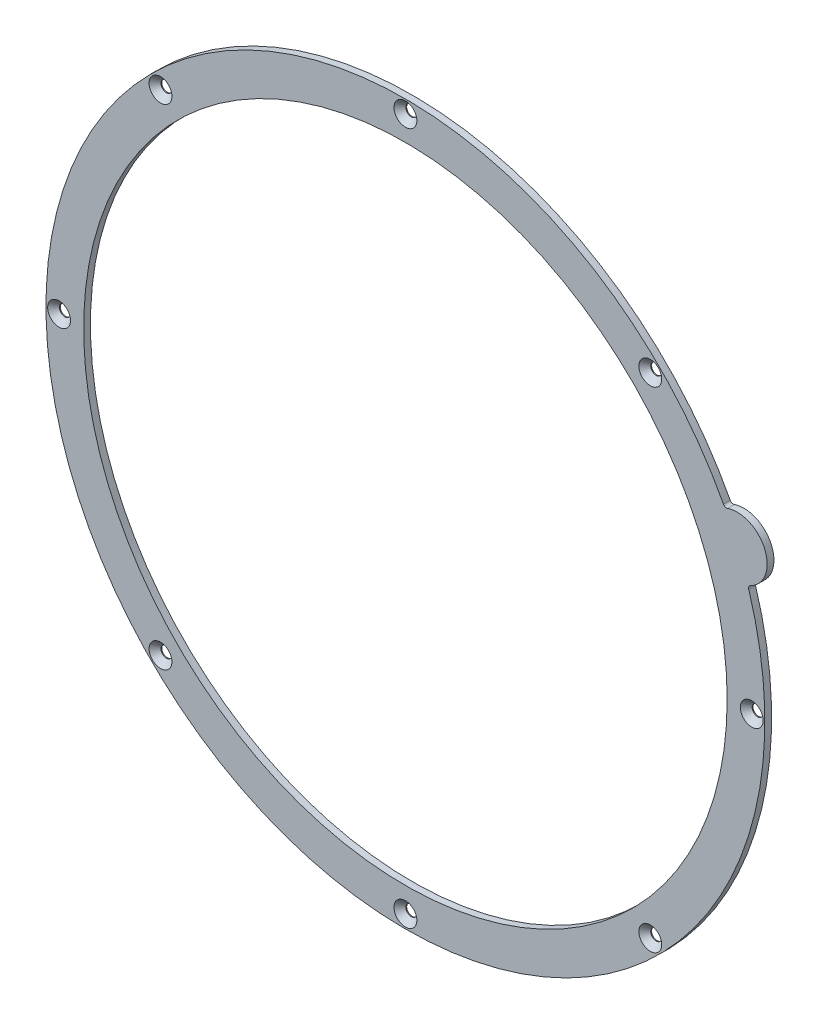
from build123d import *

# Parameters (mm, degrees)
ESQUISSE1_R                               = 212.25
ESQUISSE1_R_2                             = 190
EXTRUSION1_DEPTH                          = 4
ESQUISSE2_R                               = 3.25
EXTRUSION2_DEPTH                          = 301.193479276
CHANFREIN2_SIZE                           = 3.5
R_P_TITION_CIRCULAIRE1_COUNT              = 8
CHANFREIN2_OF_R_P_TITION_CIRCULAIRE1_SIZE = 3.5
ESQUISSE3_R                               = 17.75
EXTRUSION3_DEPTH                          = 4
CONG_1_R                                  = 2


with BuildPart() as part:
    # Esquisse1 → Extrusion1 (new body)
    with BuildSketch(Plane.XY):
        Circle(ESQUISSE1_R)
        Circle(ESQUISSE1_R_2, mode=Mode.SUBTRACT)
    extrude(amount=EXTRUSION1_DEPTH)

    # Esquisse2 → Extrusion2 (cut, through all)
    with BuildSketch(Plane.XY.offset(4)):
        with Locations((0, 204.5)):
            Circle(ESQUISSE2_R)
    extrusion2 = extrude(amount=-EXTRUSION2_DEPTH, mode=Mode.SUBTRACT)

    # Chanfrein2
    chanfrein2_edges = [part.edges().sort_by_distance(p)[0] for p in [
        (-3.25, 204.5, 4),
    ]]
    chamfer(chanfrein2_edges, length=CHANFREIN2_SIZE)

    # R_p_tition circulaire1: Extrusion2 ×8 about axis
    r_p_tition_circulaire1_axis = Axis((0, 0, 0), (0, 0, 1))
    for i in range(1, R_P_TITION_CIRCULAIRE1_COUNT):
        add(extrusion2.rotate(r_p_tition_circulaire1_axis, i * 360 / R_P_TITION_CIRCULAIRE1_COUNT), mode=Mode.SUBTRACT)

    # Chanfrein2 of R_p_tition circulaire1
    chanfrein2_of_r_p_tition_circulaire1_edges = [part.edges().sort_by_distance(p)[0] for p in [
        (-146.901433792, 142.305239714, 4),
        (-204.5, -3.25, 4),
        (-142.305239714, -146.901433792, 4),
        (3.25, -204.5, 4),
        (146.901433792, -142.305239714, 4),
        (204.5, 3.25, 4),
        (142.305239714, 146.901433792, 4),
    ]]
    chamfer(chanfrein2_of_r_p_tition_circulaire1_edges, length=CHANFREIN2_OF_R_P_TITION_CIRCULAIRE1_SIZE)

    # Esquisse3 → Extrusion3 (add)
    with BuildSketch(Plane.XY.offset(4)):
        with Locations((195.862460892, 81.128887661)):
            Circle(ESQUISSE3_R)
    extrude(amount=-EXTRUSION3_DEPTH)

    # Cong_1
    cong_1_edges = [part.edges().sort_by_distance(p)[0] for p in [
        (188.617046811, 97.332790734, 2),
        (202.197069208, 64.547716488, 2),
    ]]
    fillet(cong_1_edges, radius=CONG_1_R)


solid = part.part
